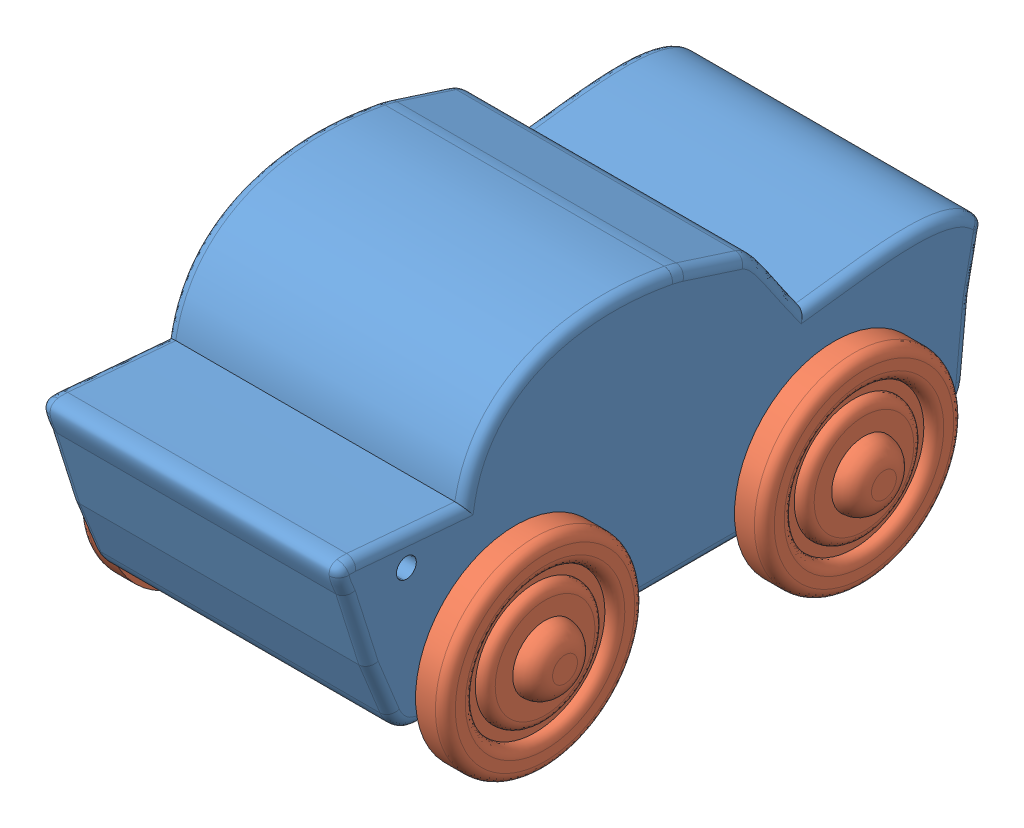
SolidWorks assembly Retro Car.SLDASM, configuration Default (file format 14000). Lengths in mm.
Overall size (41 36.05 64.96).
3 component instances, 2 part files, 4 mates.
Components (placement in the parent):
- Retro Muscle Car-1: Retro Muscle Car.SLDPRT [Default] at (32.0595 27.0391 50.3987) size (31.43 29.44 64.96)
- Car Wheels-1: Car Wheels.SLDPRT [Default] at (32.0595 31.8853 66.0574) size (41 20 20)
- Car Wheels-2: Car Wheels.SLDPRT [Default] at (32.0595 31.8853 34.0574) size (41 20 20)
Mates (geometry in assembly coordinates):
- Concentric1: concentric anti-aligned: circle of Retro Muscle Car-1; cylinder of Car Wheels-1 through (50.5595 31.8853 66.0574) axis (-1 0 0) radius 1.25
- Distance1: distance = 0.5 mm anti-aligned: plane of Car Wheels-1 through (47.5595 31.8853 66.0574) normal (-1 0 0); plane of Retro Muscle Car-1 through (47.0595 27.0391 50.3987) normal (1 0 0)
- Concentric2: concentric aligned: cylinder of Retro Muscle Car-1 through (47.0595 31.8853 34.0574) axis (-1 0 0) radius 1.5; cylinder of Car Wheels-2 through (50.5595 31.8853 34.0574) axis (-1 0 0) radius 1.25
- Distance2: distance = 0.5 mm anti-aligned: plane of Car Wheels-2 through (47.5595 31.8853 34.0574) normal (-1 0 0); plane of Retro Muscle Car-1 through (47.0595 27.0391 50.3987) normal (1 0 0)
